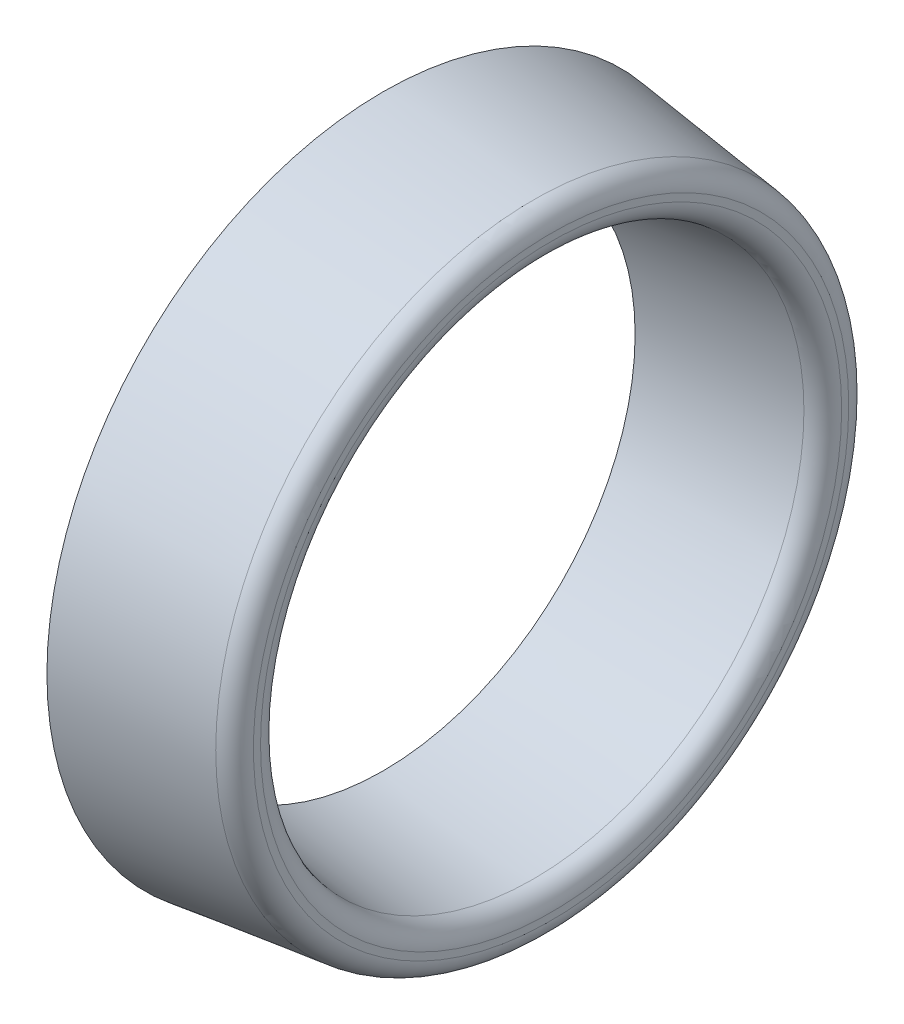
ISO-10303-21;
HEADER;
FILE_DESCRIPTION(('STEP AP214'),'2;1');
FILE_NAME('part.step','',(''),(''),'','','');
FILE_SCHEMA(('AUTOMOTIVE_DESIGN { 1 0 10303 214 1 1 1 1 }'));
ENDSEC;
DATA;
#1=APPLICATION_CONTEXT('core data for automotive mechanical design processes');
#2=APPLICATION_PROTOCOL_DEFINITION('international standard','automotive_design',2000,#1);
#3=PRODUCT_CONTEXT('',#1,'mechanical');
#4=PRODUCT('Part','Part','',(#3));
#5=PRODUCT_RELATED_PRODUCT_CATEGORY('part','',(#4));
#6=PRODUCT_DEFINITION_FORMATION('','',#4);
#7=PRODUCT_DEFINITION_CONTEXT('part definition',#1,'design');
#8=PRODUCT_DEFINITION('design','',#6,#7);
#9=PRODUCT_DEFINITION_SHAPE('','',#8);
#10=(LENGTH_UNIT() NAMED_UNIT(*) SI_UNIT(.MILLI.,.METRE.));
#11=(NAMED_UNIT(*) PLANE_ANGLE_UNIT() SI_UNIT($,.RADIAN.));
#12=(NAMED_UNIT(*) SI_UNIT($,.STERADIAN.) SOLID_ANGLE_UNIT());
#13=UNCERTAINTY_MEASURE_WITH_UNIT(LENGTH_MEASURE(1.E-05),#10,'distance_accuracy_value','');
#14=(GEOMETRIC_REPRESENTATION_CONTEXT(3) GLOBAL_UNCERTAINTY_ASSIGNED_CONTEXT((#13)) GLOBAL_UNIT_ASSIGNED_CONTEXT((#10,
#11,#12)) REPRESENTATION_CONTEXT('',''));
#15=CARTESIAN_POINT('',(0.,0.,0.));
#16=DIRECTION('',(0.,0.,1.));
#17=DIRECTION('',(1.,0.,0.));
#18=AXIS2_PLACEMENT_3D('',#15,#16,#17);
#19=CARTESIAN_POINT('',(0.,0.,0.));
#20=DIRECTION('',(1.,0.,0.));
#21=DIRECTION('',(0.,0.,-1.));
#22=AXIS2_PLACEMENT_3D('',#19,#20,#21);
#23=PLANE('',#22);
#24=CARTESIAN_POINT('',(0.,0.,0.));
#25=DIRECTION('',(1.,0.,0.));
#26=DIRECTION('',(0.,0.,-1.));
#27=AXIS2_PLACEMENT_3D('',#24,#25,#26);
#28=CIRCLE('',#27,4.7625);
#29=CARTESIAN_POINT('',(0.,0.,-4.7625));
#30=VERTEX_POINT('',#29);
#31=EDGE_CURVE('E49',#30,#30,#28,.T.);
#32=ORIENTED_EDGE('',*,*,#31,.T.);
#33=EDGE_LOOP('',(#32));
#34=FACE_BOUND('',#33,.T.);
#35=CARTESIAN_POINT('',(0.,0.,0.));
#36=DIRECTION('',(1.,0.,0.));
#37=DIRECTION('',(0.,0.,-1.));
#38=AXIS2_PLACEMENT_3D('',#35,#36,#37);
#39=CIRCLE('',#38,5.14636124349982);
#40=CARTESIAN_POINT('',(0.,0.,-5.14636124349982));
#41=VERTEX_POINT('',#40);
#42=EDGE_CURVE('E53',#41,#41,#39,.T.);
#43=ORIENTED_EDGE('',*,*,#42,.F.);
#44=EDGE_LOOP('',(#43));
#45=FACE_BOUND('',#44,.T.);
#46=ADVANCED_FACE('F26',(#34,#45),#23,.F.);
#47=CARTESIAN_POINT('',(3.175,0.,0.));
#48=DIRECTION('',(1.,0.,0.));
#49=DIRECTION('',(0.,0.,-1.));
#50=AXIS2_PLACEMENT_3D('',#47,#48,#49);
#51=PLANE('',#50);
#52=CARTESIAN_POINT('',(3.175,0.,0.));
#53=DIRECTION('',(1.,0.,0.));
#54=DIRECTION('',(0.,0.,-1.));
#55=AXIS2_PLACEMENT_3D('',#52,#53,#54);
#56=CIRCLE('',#55,5.48942130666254);
#57=CARTESIAN_POINT('',(3.175,0.,-5.48942130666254));
#58=VERTEX_POINT('',#57);
#59=EDGE_CURVE('E33',#58,#58,#56,.F.);
#60=ORIENTED_EDGE('',*,*,#59,.T.);
#61=EDGE_LOOP('',(#60));
#62=FACE_BOUND('',#61,.T.);
#63=CARTESIAN_POINT('',(3.175,0.,0.));
#64=DIRECTION('',(1.,0.,0.));
#65=DIRECTION('',(0.,0.,-1.));
#66=AXIS2_PLACEMENT_3D('',#63,#64,#65);
#67=CIRCLE('',#66,5.62307869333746);
#68=CARTESIAN_POINT('',(3.175,0.,-5.62307869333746));
#69=VERTEX_POINT('',#68);
#70=EDGE_CURVE('E37',#69,#69,#67,.T.);
#71=ORIENTED_EDGE('',*,*,#70,.T.);
#72=EDGE_LOOP('',(#71));
#73=FACE_BOUND('',#72,.T.);
#74=ADVANCED_FACE('F76',(#62,#73),#51,.T.);
#75=CARTESIAN_POINT('',(0.,0.,0.));
#76=DIRECTION('',(1.,0.,0.));
#77=DIRECTION('',(0.,0.,-1.));
#78=AXIS2_PLACEMENT_3D('',#75,#76,#77);
#79=CIRCLE('',#78,5.96613875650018);
#80=CARTESIAN_POINT('',(0.,0.,-5.96613875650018));
#81=VERTEX_POINT('',#80);
#82=EDGE_CURVE('E56',#81,#81,#79,.T.);
#83=ORIENTED_EDGE('',*,*,#82,.T.);
#84=EDGE_LOOP('',(#83));
#85=FACE_BOUND('',#84,.T.);
#86=CARTESIAN_POINT('',(0.,0.,0.));
#87=DIRECTION('',(1.,0.,0.));
#88=DIRECTION('',(0.,0.,-1.));
#89=AXIS2_PLACEMENT_3D('',#86,#87,#88);
#90=CIRCLE('',#89,6.35);
#91=CARTESIAN_POINT('',(0.,0.,-6.35));
#92=VERTEX_POINT('',#91);
#93=EDGE_CURVE('E46',#92,#92,#90,.T.);
#94=ORIENTED_EDGE('',*,*,#93,.F.);
#95=EDGE_LOOP('',(#94));
#96=FACE_BOUND('',#95,.T.);
#97=ADVANCED_FACE('F79',(#85,#96),#23,.F.);
#98=CARTESIAN_POINT('',(0.,0.,0.));
#99=DIRECTION('',(-1.,0.,0.));
#100=DIRECTION('',(0.,0.,-1.));
#101=AXIS2_PLACEMENT_3D('',#98,#99,#100);
#102=CONICAL_SURFACE('',#101,6.35,0.122173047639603);
#103=CARTESIAN_POINT('',(2.84043221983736,0.,0.));
#104=DIRECTION('',(-1.,0.,0.));
#105=DIRECTION('',(0.,0.,1.));
#106=AXIS2_PLACEMENT_3D('',#103,#104,#105);
#107=CIRCLE('',#106,6.00123877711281);
#108=CARTESIAN_POINT('',(2.84043221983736,0.,6.00123877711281));
#109=VERTEX_POINT('',#108);
#110=EDGE_CURVE('E10',#109,#109,#107,.T.);
#111=ORIENTED_EDGE('',*,*,#110,.T.);
#112=EDGE_LOOP('',(#111));
#113=FACE_BOUND('',#112,.T.);
#114=ORIENTED_EDGE('',*,*,#93,.T.);
#115=EDGE_LOOP('',(#114));
#116=FACE_BOUND('',#115,.T.);
#117=ADVANCED_FACE('F28',(#113,#116),#102,.T.);
#118=CARTESIAN_POINT('',(0.,0.,0.));
#119=DIRECTION('',(1.,0.,0.));
#120=DIRECTION('',(0.,0.,-1.));
#121=AXIS2_PLACEMENT_3D('',#118,#119,#120);
#122=CONICAL_SURFACE('',#121,4.7625,0.122173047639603);
#123=CARTESIAN_POINT('',(2.84043221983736,0.,0.));
#124=DIRECTION('',(-1.,0.,0.));
#125=DIRECTION('',(0.,0.,1.));
#126=AXIS2_PLACEMENT_3D('',#123,#124,#125);
#127=CIRCLE('',#126,5.11126122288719);
#128=CARTESIAN_POINT('',(2.84043221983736,0.,5.11126122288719));
#129=VERTEX_POINT('',#128);
#130=EDGE_CURVE('E41',#129,#129,#127,.F.);
#131=ORIENTED_EDGE('',*,*,#130,.T.);
#132=EDGE_LOOP('',(#131));
#133=FACE_BOUND('',#132,.T.);
#134=ORIENTED_EDGE('',*,*,#31,.F.);
#135=EDGE_LOOP('',(#134));
#136=FACE_BOUND('',#135,.T.);
#137=ADVANCED_FACE('F91',(#133,#136),#122,.F.);
#138=CARTESIAN_POINT('',(2.794,0.,0.));
#139=DIRECTION('',(1.,0.,0.));
#140=DIRECTION('',(0.,0.,-1.));
#141=AXIS2_PLACEMENT_3D('',#138,#139,#140);
#142=TOROIDAL_SURFACE('',#141,5.48942130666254,0.381);
#143=ORIENTED_EDGE('',*,*,#59,.F.);
#144=EDGE_LOOP('',(#143));
#145=FACE_BOUND('',#144,.T.);
#146=ORIENTED_EDGE('',*,*,#130,.F.);
#147=EDGE_LOOP('',(#146));
#148=FACE_BOUND('',#147,.T.);
#149=ADVANCED_FACE('F106',(#145,#148),#142,.T.);
#150=CARTESIAN_POINT('',(2.794,0.,0.));
#151=DIRECTION('',(1.,0.,0.));
#152=DIRECTION('',(0.,0.,-1.));
#153=AXIS2_PLACEMENT_3D('',#150,#151,#152);
#154=TOROIDAL_SURFACE('',#153,5.62307869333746,0.381);
#155=ORIENTED_EDGE('',*,*,#110,.F.);
#156=EDGE_LOOP('',(#155));
#157=FACE_BOUND('',#156,.T.);
#158=ORIENTED_EDGE('',*,*,#70,.F.);
#159=EDGE_LOOP('',(#158));
#160=FACE_BOUND('',#159,.T.);
#161=ADVANCED_FACE('F102',(#157,#160),#154,.T.);
#162=CARTESIAN_POINT('',(2.794,0.,0.));
#163=DIRECTION('',(1.,0.,0.));
#164=DIRECTION('',(0.,0.,-1.));
#165=AXIS2_PLACEMENT_3D('',#162,#163,#164);
#166=PLANE('',#165);
#167=CARTESIAN_POINT('',(2.794,0.,0.));
#168=DIRECTION('',(1.,0.,0.));
#169=DIRECTION('',(0.,0.,-1.));
#170=AXIS2_PLACEMENT_3D('',#167,#168,#169);
#171=CIRCLE('',#170,5.48942130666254);
#172=CARTESIAN_POINT('',(2.794,0.,-5.48942130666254));
#173=VERTEX_POINT('',#172);
#174=EDGE_CURVE('E59',#173,#173,#171,.T.);
#175=ORIENTED_EDGE('',*,*,#174,.T.);
#176=EDGE_LOOP('',(#175));
#177=FACE_BOUND('',#176,.T.);
#178=CARTESIAN_POINT('',(2.794,0.,0.));
#179=DIRECTION('',(1.,0.,0.));
#180=DIRECTION('',(0.,0.,-1.));
#181=AXIS2_PLACEMENT_3D('',#178,#179,#180);
#182=CIRCLE('',#181,5.62307869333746);
#183=CARTESIAN_POINT('',(2.794,0.,-5.62307869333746));
#184=VERTEX_POINT('',#183);
#185=EDGE_CURVE('E52',#184,#184,#182,.T.);
#186=ORIENTED_EDGE('',*,*,#185,.F.);
#187=EDGE_LOOP('',(#186));
#188=FACE_BOUND('',#187,.T.);
#189=ADVANCED_FACE('F65',(#177,#188),#166,.F.);
#190=CARTESIAN_POINT('',(-0.0464322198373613,0.,0.));
#191=DIRECTION('',(-1.,0.,0.));
#192=DIRECTION('',(0.,0.,-1.));
#193=AXIS2_PLACEMENT_3D('',#190,#191,#192);
#194=CONICAL_SURFACE('',#193,5.97183991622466,0.122173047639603);
#195=ORIENTED_EDGE('',*,*,#185,.T.);
#196=EDGE_LOOP('',(#195));
#197=FACE_BOUND('',#196,.T.);
#198=ORIENTED_EDGE('',*,*,#82,.F.);
#199=EDGE_LOOP('',(#198));
#200=FACE_BOUND('',#199,.T.);
#201=ADVANCED_FACE('F71',(#197,#200),#194,.F.);
#202=CARTESIAN_POINT('',(-0.0464322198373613,0.,0.));
#203=DIRECTION('',(1.,0.,0.));
#204=DIRECTION('',(0.,0.,-1.));
#205=AXIS2_PLACEMENT_3D('',#202,#203,#204);
#206=CONICAL_SURFACE('',#205,5.14066008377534,0.122173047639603);
#207=ORIENTED_EDGE('',*,*,#174,.F.);
#208=EDGE_LOOP('',(#207));
#209=FACE_BOUND('',#208,.T.);
#210=ORIENTED_EDGE('',*,*,#42,.T.);
#211=EDGE_LOOP('',(#210));
#212=FACE_BOUND('',#211,.T.);
#213=ADVANCED_FACE('F68',(#209,#212),#206,.T.);
#214=CLOSED_SHELL('',(#46,#74,#97,#117,#137,#149,#161,#189,#201,#213));
#215=MANIFOLD_SOLID_BREP('B2',#214);
#216=ADVANCED_BREP_SHAPE_REPRESENTATION('',(#18,#215),#14);
#217=SHAPE_DEFINITION_REPRESENTATION(#9,#216);
ENDSEC;
END-ISO-10303-21;
